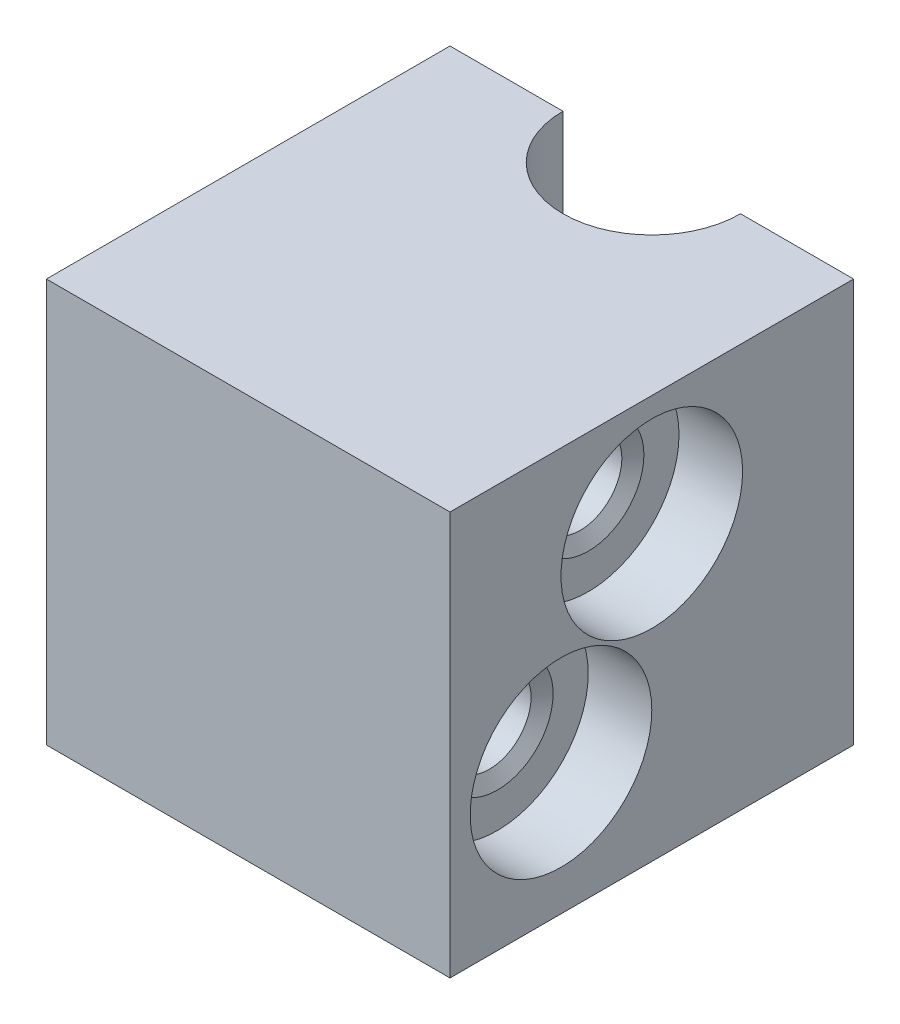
from build123d import *
from OCP.BRepFilletAPI import BRepFilletAPI_MakeChamfer

# Parameters (mm, degrees)
SKETCH1_W                       = 50.8
SKETCH1_H                       = 50.8
BOSS_EXTRUDE1_DEPTH             = 50.8
CUT_EXTRUDE1_REACH              = 89.988
M12X1_5_TAPPED_HOLE1_D          = 10.5
SKETCH7_R                       = 2.54
CUT_EXTRUDE2_DEPTH              = 8.89
F_50_0_07_DIAMETER_HOLE1_REACH  = 85.173
F_50_0_07_DIAMETER_HOLE1_BORE_R = 0.889
SKETCH12_R                      = 11.43
CUT_EXTRUDE3_DEPTH              = 8.001
F_1_4_20_TAPPED_HOLE1_D         = 5.1054
F_1_4_20_TAPPED_HOLE1_DEPTH     = 12.7
CHAMFER3_SIZE                   = 1.016
CHAMFER3_SIZE2                  = 1.75976362


with BuildPart() as part:
    # Sketch1 → Boss-Extrude1 (new body)
    with BuildSketch(Plane.XY):
        with Locations((25.4, 25.4)):
            Rectangle(SKETCH1_W, SKETCH1_H)
    extrude(amount=BOSS_EXTRUDE1_DEPTH)

    # Sketch2 → Cut-Extrude1 (cut, up to next)
    with BuildSketch(Plane(origin=(0, 50.8, 0), x_dir=(1, 0, 0), z_dir=(0, 1, 0)), mode=Mode.PRIVATE) as cut_extrude1_sk1:
        with BuildLine():
            Line((14.224, 0), (36.576, 0))
            ThreePointArc((36.576, 0), (25.4, -11.176), (14.224, 0))
        make_face()
    cut_extrude1_tool1 = extrude(cut_extrude1_sk1.sketch, amount=-CUT_EXTRUDE1_REACH, mode=Mode.PRIVATE) & part.part
    add(cut_extrude1_tool1.solids().sort_by_distance((25.4, 50.8, 4.743242))[0], mode=Mode.SUBTRACT)

    # M12x1.5 Tapped Hole1 (through all)
    with Locations(Plane(origin=(50.8, 0, 0), x_dir=(0, 0, -1), z_dir=(1, 0, 0))):
        with Locations((-36.83, 16.51), (-25.4, 36.83)):
            Hole(M12X1_5_TAPPED_HOLE1_D / 2)

    # Sketch7 → Cut-Extrude2 (cut)
    with BuildSketch(Plane.XZ):
        with Locations(Location((25.4, 25.4, 0), (0, 0, 270))):
            Circle(SKETCH7_R)
        with Locations(Location((25.4, 36.83, 0), (0, 0, 270))):
            Circle(SKETCH7_R)
    extrude(amount=-CUT_EXTRUDE2_DEPTH, mode=Mode.SUBTRACT)

    # 50 _0.07_ Diameter Hole1 bore → 50 _0.07_ Diameter Hole1 (cut, up to next)
    with BuildSketch(Plane(origin=(0, 8.89, 0), x_dir=(-1, 0, 0), z_dir=(0, -1, 0)), mode=Mode.PRIVATE) as f_50_0_07_diameter_hole1_sk1:
        with Locations((-25.4, -25.4)):
            Circle(F_50_0_07_DIAMETER_HOLE1_BORE_R)
    f_50_0_07_diameter_hole1_tool1 = extrude(f_50_0_07_diameter_hole1_sk1.sketch, amount=-F_50_0_07_DIAMETER_HOLE1_REACH, mode=Mode.PRIVATE) & part.part
    # 50 _0.07_ Diameter Hole1 bore → 50 _0.07_ Diameter Hole1 (cut, up to next)
    with BuildSketch(Plane(origin=(0, 8.89, 0), x_dir=(-1, 0, 0), z_dir=(0, -1, 0)), mode=Mode.PRIVATE) as f_50_0_07_diameter_hole1_sk2:
        with Locations((-25.4, -36.83)):
            Circle(F_50_0_07_DIAMETER_HOLE1_BORE_R)
    f_50_0_07_diameter_hole1_tool2 = extrude(f_50_0_07_diameter_hole1_sk2.sketch, amount=-F_50_0_07_DIAMETER_HOLE1_REACH, mode=Mode.PRIVATE) & part.part
    add(f_50_0_07_diameter_hole1_tool1.solids().sort_by_distance((25.4, 8.89, 25.4))[0], mode=Mode.SUBTRACT)
    add(f_50_0_07_diameter_hole1_tool2.solids().sort_by_distance((25.4, 8.89, 36.83))[0], mode=Mode.SUBTRACT)

    # Sketch12 → Cut-Extrude3 (cut)
    with BuildSketch(Plane(origin=(50.8, 0, 0), x_dir=(0, 0, -1), z_dir=(1, 0, 0))):
        with Locations((-36.83, 16.51)):
            Circle(SKETCH12_R)
        with Locations((-25.4, 36.83)):
            Circle(SKETCH12_R)
    cut_extrude3 = extrude(amount=-CUT_EXTRUDE3_DEPTH, mode=Mode.SUBTRACT)

    # Mirror1: Cut-Extrude3 across plane
    add(cut_extrude3.mirror(Plane(origin=(25.4, 0, 0), x_dir=(0, 0, 1), z_dir=(1, 0, 0))), mode=Mode.SUBTRACT)

    # 1_4-20 Tapped Hole1
    with Locations(Plane(origin=(0, 0, 0), x_dir=(-1, 0, 0), z_dir=(0, 0, -1))):
        with Locations((-6.35, 9.4488), (-44.45, 9.4488), (-44.45, 41.1988), (-6.35, 41.1988)):
            Hole(F_1_4_20_TAPPED_HOLE1_D / 2, depth=F_1_4_20_TAPPED_HOLE1_DEPTH)

    # Chamfer3: one chamfer whose edges measure the first distance from different faces: ONE call of the kernel's chamfer builder (chamfer() names one face for all edges)
    chamfer3_edges_1 = [part.edges().sort_by_distance(p)[0] for p in [
        (42.799, 16.51, 31.58),
        (8.001, 16.51, 31.58),
    ]]
    chamfer3_side_1 = [part.faces().sort_by_distance(p)[0] for p in [
        (25.4, 16.51, 31.58),
    ]]
    chamfer3_edges_2 = [part.edges().sort_by_distance(p)[0] for p in [
        (42.799, 36.83, 20.15),
        (8.001, 36.83, 20.15),
    ]]
    chamfer3_side_2 = [part.faces().sort_by_distance(p)[0] for p in [
        (25.4, 36.83, 20.15),
    ]]
    chamfer3 = BRepFilletAPI_MakeChamfer(part.part.solid().wrapped)
    for e in chamfer3_edges_1:
        chamfer3.Add(CHAMFER3_SIZE, CHAMFER3_SIZE2, e.wrapped, chamfer3_side_1[0].wrapped)  # the first distance lies on this face
    for e in chamfer3_edges_2:
        chamfer3.Add(CHAMFER3_SIZE, CHAMFER3_SIZE2, e.wrapped, chamfer3_side_2[0].wrapped)  # the first distance lies on this face
    add(Compound.cast(chamfer3.Shape()), mode=Mode.REPLACE)


solid = part.part
